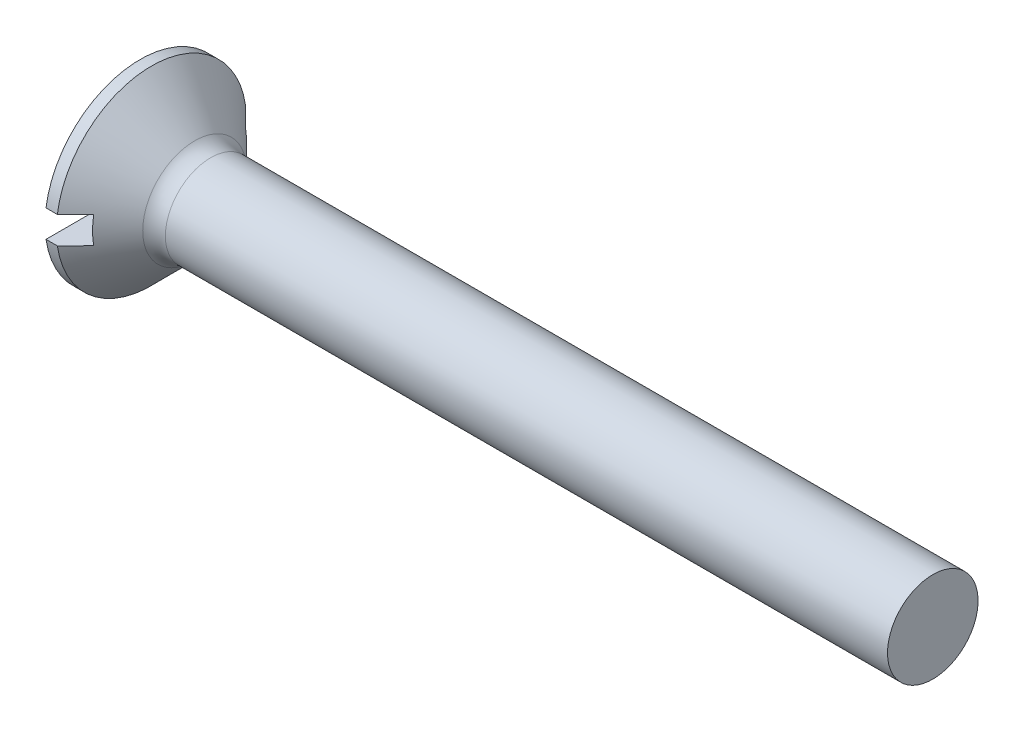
ISO-10303-21;
HEADER;
FILE_DESCRIPTION(('STEP AP214'),'2;1');
FILE_NAME('part.step','',(''),(''),'','','');
FILE_SCHEMA(('AUTOMOTIVE_DESIGN { 1 0 10303 214 1 1 1 1 }'));
ENDSEC;
DATA;
#1=APPLICATION_CONTEXT('core data for automotive mechanical design processes');
#2=APPLICATION_PROTOCOL_DEFINITION('international standard','automotive_design',2000,#1);
#3=PRODUCT_CONTEXT('',#1,'mechanical');
#4=PRODUCT('Part','Part','',(#3));
#5=PRODUCT_RELATED_PRODUCT_CATEGORY('part','',(#4));
#6=PRODUCT_DEFINITION_FORMATION('','',#4);
#7=PRODUCT_DEFINITION_CONTEXT('part definition',#1,'design');
#8=PRODUCT_DEFINITION('design','',#6,#7);
#9=PRODUCT_DEFINITION_SHAPE('','',#8);
#10=(LENGTH_UNIT() NAMED_UNIT(*) SI_UNIT(.MILLI.,.METRE.));
#11=(NAMED_UNIT(*) PLANE_ANGLE_UNIT() SI_UNIT($,.RADIAN.));
#12=(NAMED_UNIT(*) SI_UNIT($,.STERADIAN.) SOLID_ANGLE_UNIT());
#13=UNCERTAINTY_MEASURE_WITH_UNIT(LENGTH_MEASURE(1.E-05),#10,'distance_accuracy_value','');
#14=(GEOMETRIC_REPRESENTATION_CONTEXT(3) GLOBAL_UNCERTAINTY_ASSIGNED_CONTEXT((#13)) GLOBAL_UNIT_ASSIGNED_CONTEXT((#10,
#11,#12)) REPRESENTATION_CONTEXT('',''));
#15=CARTESIAN_POINT('',(0.,0.,0.));
#16=DIRECTION('',(0.,0.,1.));
#17=DIRECTION('',(1.,0.,0.));
#18=AXIS2_PLACEMENT_3D('',#15,#16,#17);
#19=CARTESIAN_POINT('',(0.,0.,0.));
#20=DIRECTION('',(-1.,0.,0.));
#21=DIRECTION('',(0.,0.,1.));
#22=AXIS2_PLACEMENT_3D('',#19,#20,#21);
#23=PLANE('',#22);
#24=DIRECTION('',(0.,0.,-1.));
#25=VECTOR('',#24,1.);
#26=CARTESIAN_POINT('',(0.,0.6,4.2));
#27=LINE('',#26,#25);
#28=CARTESIAN_POINT('',(0.,0.6,4.15692193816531));
#29=VERTEX_POINT('',#28);
#30=CARTESIAN_POINT('',(0.,0.599999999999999,-4.15692193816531));
#31=VERTEX_POINT('',#30);
#32=EDGE_CURVE('E170',#29,#31,#27,.T.);
#33=ORIENTED_EDGE('',*,*,#32,.F.);
#34=CARTESIAN_POINT('',(0.,0.,0.));
#35=DIRECTION('',(-1.,0.,0.));
#36=DIRECTION('',(0.,0.,1.));
#37=AXIS2_PLACEMENT_3D('',#34,#35,#36);
#38=CIRCLE('',#37,4.2);
#39=EDGE_CURVE('E114',#29,#31,#38,.T.);
#40=ORIENTED_EDGE('',*,*,#39,.T.);
#41=EDGE_LOOP('',(#33,#40));
#42=FACE_BOUND('',#41,.T.);
#43=ADVANCED_FACE('F33',(#42),#23,.T.);
#44=CARTESIAN_POINT('',(-6.34999999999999,0.,0.));
#45=DIRECTION('',(-1.,0.,0.));
#46=DIRECTION('',(0.,0.,1.));
#47=AXIS2_PLACEMENT_3D('',#44,#45,#46);
#48=CYLINDRICAL_SURFACE('',#47,4.2);
#49=DIRECTION('',(-1.,0.,0.));
#50=VECTOR('',#49,1.);
#51=CARTESIAN_POINT('',(-6.34999999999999,0.599999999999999,-4.15692193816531));
#52=LINE('',#51,#50);
#53=CARTESIAN_POINT('',(0.500000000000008,0.599999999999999,-4.15692193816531));
#54=VERTEX_POINT('',#53);
#55=EDGE_CURVE('E61',#31,#54,#52,.F.);
#56=ORIENTED_EDGE('',*,*,#55,.F.);
#57=ORIENTED_EDGE('',*,*,#39,.F.);
#58=DIRECTION('',(-1.,0.,0.));
#59=VECTOR('',#58,1.);
#60=CARTESIAN_POINT('',(-6.34999999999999,0.6,4.15692193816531));
#61=LINE('',#60,#59);
#62=CARTESIAN_POINT('',(0.500000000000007,0.6,4.15692193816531));
#63=VERTEX_POINT('',#62);
#64=EDGE_CURVE('E176',#63,#29,#61,.T.);
#65=ORIENTED_EDGE('',*,*,#64,.F.);
#66=CARTESIAN_POINT('',(0.500000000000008,0.,0.));
#67=DIRECTION('',(-1.,0.,0.));
#68=DIRECTION('',(0.,0.,1.));
#69=AXIS2_PLACEMENT_3D('',#66,#67,#68);
#70=CIRCLE('',#69,4.2);
#71=EDGE_CURVE('E108',#63,#54,#70,.T.);
#72=ORIENTED_EDGE('',*,*,#71,.T.);
#73=EDGE_LOOP('',(#56,#57,#65,#72));
#74=FACE_BOUND('',#73,.T.);
#75=ADVANCED_FACE('F154',(#74),#48,.T.);
#76=DIRECTION('',(0.,0.,1.));
#77=VECTOR('',#76,1.);
#78=CARTESIAN_POINT('',(0.,-0.600000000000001,-4.2));
#79=LINE('',#78,#77);
#80=CARTESIAN_POINT('',(0.,-0.600000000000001,-4.15692193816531));
#81=VERTEX_POINT('',#80);
#82=CARTESIAN_POINT('',(0.,-0.600000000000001,4.15692193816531));
#83=VERTEX_POINT('',#82);
#84=EDGE_CURVE('E102',#81,#83,#79,.T.);
#85=ORIENTED_EDGE('',*,*,#84,.F.);
#86=EDGE_CURVE('E110',#81,#83,#38,.T.);
#87=ORIENTED_EDGE('',*,*,#86,.T.);
#88=EDGE_LOOP('',(#85,#87));
#89=FACE_BOUND('',#88,.T.);
#90=ADVANCED_FACE('F156',(#89),#23,.T.);
#91=DIRECTION('',(-1.,0.,0.));
#92=VECTOR('',#91,1.);
#93=CARTESIAN_POINT('',(-6.34999999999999,-0.600000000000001,4.15692193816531));
#94=LINE('',#93,#92);
#95=CARTESIAN_POINT('',(0.500000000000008,-0.600000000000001,4.15692193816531));
#96=VERTEX_POINT('',#95);
#97=EDGE_CURVE('E175',#83,#96,#94,.F.);
#98=ORIENTED_EDGE('',*,*,#97,.F.);
#99=ORIENTED_EDGE('',*,*,#86,.F.);
#100=DIRECTION('',(-1.,0.,0.));
#101=VECTOR('',#100,1.);
#102=CARTESIAN_POINT('',(-6.34999999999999,-0.600000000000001,-4.15692193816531));
#103=LINE('',#102,#101);
#104=CARTESIAN_POINT('',(0.500000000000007,-0.600000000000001,-4.15692193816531));
#105=VERTEX_POINT('',#104);
#106=EDGE_CURVE('E173',#105,#81,#103,.T.);
#107=ORIENTED_EDGE('',*,*,#106,.F.);
#108=EDGE_CURVE('E111',#105,#96,#70,.T.);
#109=ORIENTED_EDGE('',*,*,#108,.T.);
#110=EDGE_LOOP('',(#98,#99,#107,#109));
#111=FACE_BOUND('',#110,.T.);
#112=ADVANCED_FACE('F151',(#111),#48,.T.);
#113=CARTESIAN_POINT('',(0.500000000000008,0.,0.));
#114=DIRECTION('',(-1.,0.,0.));
#115=DIRECTION('',(0.,0.,1.));
#116=AXIS2_PLACEMENT_3D('',#113,#114,#115);
#117=CONICAL_SURFACE('',#116,4.2,0.78539816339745);
#118=CARTESIAN_POINT('',(-4.56300554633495,0.599999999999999,-9.24355298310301));
#119=CARTESIAN_POINT('',(-4.24600723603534,0.599999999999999,-8.9258823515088));
#120=CARTESIAN_POINT('',(-3.92903833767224,0.599999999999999,-8.60818235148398));
#121=CARTESIAN_POINT('',(-3.29519089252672,0.599999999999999,-7.97268003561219));
#122=CARTESIAN_POINT('',(-2.97831234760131,0.599999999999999,-7.65487771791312));
#123=CARTESIAN_POINT('',(-2.34455187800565,0.599999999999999,-7.01900148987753));
#124=CARTESIAN_POINT('',(-2.02767001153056,0.599999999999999,-6.70092752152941));
#125=CARTESIAN_POINT('',(-1.39411705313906,0.599999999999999,-6.06458161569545));
#126=CARTESIAN_POINT('',(-1.07744595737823,0.599999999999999,-5.74630968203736));
#127=CARTESIAN_POINT('',(-0.439782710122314,0.599999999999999,-5.1047678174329));
#128=CARTESIAN_POINT('',(-0.118795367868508,0.599999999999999,-4.78149310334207));
#129=CARTESIAN_POINT('',(0.362237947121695,0.599999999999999,-4.2961185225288));
#130=CARTESIAN_POINT('',(0.522512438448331,0.599999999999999,-4.13424518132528));
#131=CARTESIAN_POINT('',(0.842841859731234,0.599999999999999,-3.81028322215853));
#132=CARTESIAN_POINT('',(1.00289679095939,0.6,-3.64819460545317));
#133=CARTESIAN_POINT('',(1.32264436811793,0.6,-3.32374686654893));
#134=CARTESIAN_POINT('',(1.48233710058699,0.6,-3.16138782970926));
#135=CARTESIAN_POINT('',(1.80122734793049,0.6,-2.83617699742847));
#136=CARTESIAN_POINT('',(1.96042485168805,0.6,-2.67332519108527));
#137=CARTESIAN_POINT('',(2.27798310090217,0.6,-2.346837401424));
#138=CARTESIAN_POINT('',(2.43634393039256,0.6,-2.1832015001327));
#139=CARTESIAN_POINT('',(2.67269924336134,0.6,-1.93661567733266));
#140=CARTESIAN_POINT('',(2.75128528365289,0.6,-1.8542332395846));
#141=CARTESIAN_POINT('',(2.90787263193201,0.6,-1.68891500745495));
#142=CARTESIAN_POINT('',(2.9858739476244,0.6,-1.60597922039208));
#143=CARTESIAN_POINT('',(3.10544684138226,0.6,-1.47745401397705));
#144=CARTESIAN_POINT('',(3.14733724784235,0.6,-1.43216144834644));
#145=CARTESIAN_POINT('',(3.23076972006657,0.6,-1.34125476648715));
#146=CARTESIAN_POINT('',(3.27231177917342,0.6,-1.29564064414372));
#147=CARTESIAN_POINT('',(3.35490511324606,0.6,-1.20402456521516));
#148=CARTESIAN_POINT('',(3.39595670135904,0.6,-1.15802289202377));
#149=CARTESIAN_POINT('',(3.47741398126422,0.6,-1.06545539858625));
#150=CARTESIAN_POINT('',(3.51781969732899,0.6,-1.01888959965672));
#151=CARTESIAN_POINT('',(3.61534617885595,0.6,-0.904304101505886));
#152=CARTESIAN_POINT('',(3.67198890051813,0.6,-0.835870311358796));
#153=CARTESIAN_POINT('',(3.75443491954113,0.6,-0.731128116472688));
#154=CARTESIAN_POINT('',(3.78151872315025,0.6,-0.695835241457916));
#155=CARTESIAN_POINT('',(3.83442818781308,0.6,-0.624333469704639));
#156=CARTESIAN_POINT('',(3.86025411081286,0.6,-0.58812476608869));
#157=CARTESIAN_POINT('',(3.91931375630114,0.6,-0.500871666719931));
#158=CARTESIAN_POINT('',(3.95177061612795,0.6,-0.449276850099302));
#159=CARTESIAN_POINT('',(3.99577967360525,0.6,-0.369336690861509));
#160=CARTESIAN_POINT('',(4.00966067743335,0.6,-0.342288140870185));
#161=CARTESIAN_POINT('',(4.03525638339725,0.6,-0.287195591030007));
#162=CARTESIAN_POINT('',(4.04697271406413,0.6,-0.259152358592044));
#163=CARTESIAN_POINT('',(4.06984222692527,0.6,-0.195380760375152));
#164=CARTESIAN_POINT('',(4.08024433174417,0.6,-0.159369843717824));
#165=CARTESIAN_POINT('',(4.09489065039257,0.6,-0.0861793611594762));
#166=CARTESIAN_POINT('',(4.09915715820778,0.6,-0.0490045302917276));
#167=CARTESIAN_POINT('',(4.10061628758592,0.6,0.0256851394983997));
#168=CARTESIAN_POINT('',(4.09777267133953,0.6,0.0632007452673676));
#169=CARTESIAN_POINT('',(4.08560858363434,0.6,0.137201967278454));
#170=CARTESIAN_POINT('',(4.07626994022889,0.6,0.173684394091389));
#171=CARTESIAN_POINT('',(4.05240105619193,0.6,0.246171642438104));
#172=CARTESIAN_POINT('',(4.03770931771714,0.6,0.282120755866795));
#173=CARTESIAN_POINT('',(4.0048507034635,0.6,0.352421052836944));
#174=CARTESIAN_POINT('',(3.98667753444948,0.6,0.386769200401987));
#175=CARTESIAN_POINT('',(3.94786976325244,0.6,0.454391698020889));
#176=CARTESIAN_POINT('',(3.92721638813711,0.6,0.487655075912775));
#177=CARTESIAN_POINT('',(3.88433578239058,0.6,0.553097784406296));
#178=CARTESIAN_POINT('',(3.86210991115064,0.6,0.585278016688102));
#179=CARTESIAN_POINT('',(3.81457382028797,0.6,0.651581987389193));
#180=CARTESIAN_POINT('',(3.7891630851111,0.6,0.685633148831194));
#181=CARTESIAN_POINT('',(3.73740972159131,0.6,0.753022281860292));
#182=CARTESIAN_POINT('',(3.71106696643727,0.6,0.786360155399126));
#183=CARTESIAN_POINT('',(3.63101189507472,0.6,0.885596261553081));
#184=CARTESIAN_POINT('',(3.57629754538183,0.6,0.950683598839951));
#185=CARTESIAN_POINT('',(3.46525380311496,0.6,1.07965626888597));
#186=CARTESIAN_POINT('',(3.40892163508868,0.6,1.14353918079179));
#187=CARTESIAN_POINT('',(3.29530585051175,0.6,1.27041803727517));
#188=CARTESIAN_POINT('',(3.23802251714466,0.6,1.33341423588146));
#189=CARTESIAN_POINT('',(3.12298479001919,0.6,1.45862383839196));
#190=CARTESIAN_POINT('',(3.06523233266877,0.6,1.52083902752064));
#191=CARTESIAN_POINT('',(2.94927074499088,0.6,1.64485037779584));
#192=CARTESIAN_POINT('',(2.89106158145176,0.6,1.70664650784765));
#193=CARTESIAN_POINT('',(2.71607782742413,0.6,1.8914362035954));
#194=CARTESIAN_POINT('',(2.598818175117,0.6,2.01396998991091));
#195=CARTESIAN_POINT('',(2.36411448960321,0.6,2.25774708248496));
#196=CARTESIAN_POINT('',(2.2466739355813,0.6,2.37899374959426));
#197=CARTESIAN_POINT('',(2.011320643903,0.6,2.62102822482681));
#198=CARTESIAN_POINT('',(1.89340790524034,0.6,2.74181603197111));
#199=CARTESIAN_POINT('',(1.53920067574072,0.6,3.10372997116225));
#200=CARTESIAN_POINT('',(1.30244210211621,0.6,3.34440153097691));
#201=CARTESIAN_POINT('',(0.828195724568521,0.6,3.82523070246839));
#202=CARTESIAN_POINT('',(0.590707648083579,0.6,4.06538804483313));
#203=CARTESIAN_POINT('',(0.115359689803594,0.6,4.54532999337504));
#204=CARTESIAN_POINT('',(-0.122500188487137,0.6,4.78511460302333));
#205=CARTESIAN_POINT('',(-0.598435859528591,0.6,5.26442998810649));
#206=CARTESIAN_POINT('',(-0.836511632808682,0.6,5.50396078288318));
#207=CARTESIAN_POINT('',(-1.31282357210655,0.6,5.9828640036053));
#208=CARTESIAN_POINT('',(-1.55105973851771,0.600000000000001,6.22223642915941));
#209=CARTESIAN_POINT('',(-2.26588146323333,0.600000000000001,6.94013600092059));
#210=CARTESIAN_POINT('',(-2.74263267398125,0.600000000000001,7.41849819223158));
#211=CARTESIAN_POINT('',(-3.33143893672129,0.600000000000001,8.0089998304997));
#212=CARTESIAN_POINT('',(-3.44338145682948,0.600000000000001,8.12125154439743));
#213=CARTESIAN_POINT('',(-3.66728071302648,0.600000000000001,8.34574469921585));
#214=CARTESIAN_POINT('',(-3.77923744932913,0.600000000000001,8.45798613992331));
#215=CARTESIAN_POINT('',(-4.0031582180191,0.600000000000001,8.68245495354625));
#216=CARTESIAN_POINT('',(-4.11512225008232,0.600000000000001,8.79468232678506));
#217=CARTESIAN_POINT('',(-4.33905795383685,0.600000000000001,9.019125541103));
#218=CARTESIAN_POINT('',(-4.45102962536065,0.600000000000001,9.13134138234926));
#219=CARTESIAN_POINT('',(-4.56300554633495,0.600000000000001,9.24355298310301));
#220=B_SPLINE_CURVE_WITH_KNOTS('',3,(#118,#119,#120,#121,#122,#123,#124,#125,#126,#127,#128,
#129,#130,#131,#132,#133,#134,#135,#136,#137,#138,#139,#140,#141,#142,#143,#144,#145,#146,#147,
#148,#149,#150,#151,#152,#153,#154,#155,#156,#157,#158,#159,#160,#161,#162,#163,#164,#165,#166,
#167,#168,#169,#170,#171,#172,#173,#174,#175,#176,#177,#178,#179,#180,#181,#182,#183,#184,#185,
#186,#187,#188,#189,#190,#191,#192,#193,#194,#195,#196,#197,#198,#199,#200,#201,#202,#203,#204,
#205,#206,#207,#208,#209,#210,#211,#212,#213,#214,#215,#216,#217,#218,#219),.UNSPECIFIED.,.F.,
.F.,(4,2,2,2,2,2,2,2,2,2,2,2,2,2,2,2,2,2,2,2,2,2,2,2,2,2,2,2,2,2,2,2,2,2,2,2,2,2,2,2,2,2,2,2,2,
2,2,2,2,2,4),(0.,1.34633691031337,2.6926997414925,4.03964677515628,5.38656852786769,
6.75326280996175,7.43664982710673,8.12003286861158,8.80323043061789,9.48644321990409,
10.1695860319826,10.5111450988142,10.8526996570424,11.03778202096,11.2228679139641,
11.4078285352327,11.5927821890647,11.8592146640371,11.9926530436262,12.1260635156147,
12.3086320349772,12.399769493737,12.490838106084,12.6028793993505,12.7145125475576,
12.8267158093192,12.939234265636,13.0554743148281,13.1719265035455,13.2893234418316,
13.4066201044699,13.5340600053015,13.6615173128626,13.91655652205,14.1720630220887,
14.4274947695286,14.6821578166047,14.9368395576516,15.4456347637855,15.9520298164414,
16.4584259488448,17.4712394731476,18.484493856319,19.4977387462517,20.5108998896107,
21.5240635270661,23.5501676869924,24.0257559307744,24.5013524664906,24.9769345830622,
25.4525083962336),.UNSPECIFIED.);
#221=CARTESIAN_POINT('',(1.3,0.6,3.34664010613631));
#222=VERTEX_POINT('',#221);
#223=EDGE_CURVE('E11',#222,#63,#220,.T.);
#224=ORIENTED_EDGE('',*,*,#223,.F.);
#225=CARTESIAN_POINT('',(1.3,0.,0.));
#226=DIRECTION('',(1.,0.,0.));
#227=DIRECTION('',(0.,0.,-1.));
#228=AXIS2_PLACEMENT_3D('',#225,#226,#227);
#229=CIRCLE('',#228,3.40000000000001);
#230=CARTESIAN_POINT('',(1.3,-0.600000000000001,3.34664010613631));
#231=VERTEX_POINT('',#230);
#232=EDGE_CURVE('E90',#231,#222,#229,.F.);
#233=ORIENTED_EDGE('',*,*,#232,.F.);
#234=CARTESIAN_POINT('',(-4.56300554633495,-0.600000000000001,9.24355298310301));
#235=CARTESIAN_POINT('',(-4.24600723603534,-0.600000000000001,8.9258823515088));
#236=CARTESIAN_POINT('',(-3.92903833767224,-0.600000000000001,8.60818235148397));
#237=CARTESIAN_POINT('',(-3.29519089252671,-0.600000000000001,7.97268003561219));
#238=CARTESIAN_POINT('',(-2.9783123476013,-0.600000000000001,7.65487771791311));
#239=CARTESIAN_POINT('',(-2.34455187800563,-0.600000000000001,7.01900148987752));
#240=CARTESIAN_POINT('',(-2.02767001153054,-0.600000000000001,6.7009275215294));
#241=CARTESIAN_POINT('',(-1.39411705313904,-0.600000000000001,6.06458161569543));
#242=CARTESIAN_POINT('',(-1.07744595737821,-0.600000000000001,5.74630968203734));
#243=CARTESIAN_POINT('',(-0.439782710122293,-0.600000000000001,5.10476781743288));
#244=CARTESIAN_POINT('',(-0.118795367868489,-0.600000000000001,4.78149310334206));
#245=CARTESIAN_POINT('',(0.362237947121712,-0.600000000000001,4.29611852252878));
#246=CARTESIAN_POINT('',(0.522512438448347,-0.600000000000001,4.13424518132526));
#247=CARTESIAN_POINT('',(0.842841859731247,-0.600000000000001,3.81028322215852));
#248=CARTESIAN_POINT('',(1.0028967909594,-0.600000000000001,3.64819460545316));
#249=CARTESIAN_POINT('',(1.32264436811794,-0.600000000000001,3.32374686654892));
#250=CARTESIAN_POINT('',(1.482337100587,-0.600000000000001,3.16138782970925));
#251=CARTESIAN_POINT('',(1.8012273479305,-0.600000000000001,2.83617699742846));
#252=CARTESIAN_POINT('',(1.96042485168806,-0.600000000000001,2.67332519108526));
#253=CARTESIAN_POINT('',(2.27798310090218,-0.600000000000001,2.346837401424));
#254=CARTESIAN_POINT('',(2.43634393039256,-0.600000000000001,2.18320150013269));
#255=CARTESIAN_POINT('',(2.67269924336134,-0.600000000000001,1.93661567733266));
#256=CARTESIAN_POINT('',(2.75128528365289,-0.600000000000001,1.85423323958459));
#257=CARTESIAN_POINT('',(2.90787263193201,-0.600000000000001,1.68891500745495));
#258=CARTESIAN_POINT('',(2.98587394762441,-0.600000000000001,1.60597922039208));
#259=CARTESIAN_POINT('',(3.10544684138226,-0.600000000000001,1.47745401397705));
#260=CARTESIAN_POINT('',(3.14733724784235,-0.600000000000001,1.43216144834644));
#261=CARTESIAN_POINT('',(3.23076972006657,-0.600000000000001,1.34125476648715));
#262=CARTESIAN_POINT('',(3.27231177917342,-0.600000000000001,1.29564064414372));
#263=CARTESIAN_POINT('',(3.35490511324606,-0.600000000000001,1.20402456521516));
#264=CARTESIAN_POINT('',(3.39595670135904,-0.600000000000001,1.15802289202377));
#265=CARTESIAN_POINT('',(3.47741398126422,-0.600000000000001,1.06545539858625));
#266=CARTESIAN_POINT('',(3.51781969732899,-0.600000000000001,1.01888959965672));
#267=CARTESIAN_POINT('',(3.61534617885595,-0.600000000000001,0.904304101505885));
#268=CARTESIAN_POINT('',(3.67198890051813,-0.600000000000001,0.835870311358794));
#269=CARTESIAN_POINT('',(3.75443491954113,-0.600000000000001,0.731128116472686));
#270=CARTESIAN_POINT('',(3.78151872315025,-0.600000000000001,0.695835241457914));
#271=CARTESIAN_POINT('',(3.83442818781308,-0.600000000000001,0.624333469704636));
#272=CARTESIAN_POINT('',(3.86025411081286,-0.600000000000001,0.588124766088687));
#273=CARTESIAN_POINT('',(3.91931375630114,-0.600000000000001,0.500871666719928));
#274=CARTESIAN_POINT('',(3.95177061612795,-0.600000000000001,0.449276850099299));
#275=CARTESIAN_POINT('',(3.99577967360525,-0.600000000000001,0.369336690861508));
#276=CARTESIAN_POINT('',(4.00966067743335,-0.600000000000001,0.342288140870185));
#277=CARTESIAN_POINT('',(4.03525638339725,-0.600000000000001,0.287195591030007));
#278=CARTESIAN_POINT('',(4.04697271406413,-0.600000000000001,0.259152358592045));
#279=CARTESIAN_POINT('',(4.06984222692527,-0.600000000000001,0.195380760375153));
#280=CARTESIAN_POINT('',(4.08024433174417,-0.600000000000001,0.159369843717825));
#281=CARTESIAN_POINT('',(4.09489065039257,-0.600000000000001,0.0861793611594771));
#282=CARTESIAN_POINT('',(4.09915715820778,-0.600000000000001,0.0490045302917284));
#283=CARTESIAN_POINT('',(4.10061628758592,-0.600000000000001,-0.0256851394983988));
#284=CARTESIAN_POINT('',(4.09777267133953,-0.600000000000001,-0.0632007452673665));
#285=CARTESIAN_POINT('',(4.08560858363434,-0.600000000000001,-0.137201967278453));
#286=CARTESIAN_POINT('',(4.07626994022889,-0.600000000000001,-0.173684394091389));
#287=CARTESIAN_POINT('',(4.05240105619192,-0.600000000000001,-0.246171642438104));
#288=CARTESIAN_POINT('',(4.03770931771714,-0.600000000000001,-0.282120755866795));
#289=CARTESIAN_POINT('',(4.0048507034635,-0.600000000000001,-0.352421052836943));
#290=CARTESIAN_POINT('',(3.98667753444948,-0.600000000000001,-0.386769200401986));
#291=CARTESIAN_POINT('',(3.94786976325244,-0.600000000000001,-0.454391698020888));
#292=CARTESIAN_POINT('',(3.92721638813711,-0.600000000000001,-0.487655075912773));
#293=CARTESIAN_POINT('',(3.88433578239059,-0.600000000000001,-0.553097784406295));
#294=CARTESIAN_POINT('',(3.86210991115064,-0.600000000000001,-0.585278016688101));
#295=CARTESIAN_POINT('',(3.81457382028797,-0.600000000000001,-0.651581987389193));
#296=CARTESIAN_POINT('',(3.7891630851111,-0.600000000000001,-0.685633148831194));
#297=CARTESIAN_POINT('',(3.73740972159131,-0.600000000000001,-0.753022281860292));
#298=CARTESIAN_POINT('',(3.71106696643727,-0.600000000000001,-0.786360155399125));
#299=CARTESIAN_POINT('',(3.63101189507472,-0.600000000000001,-0.88559626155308));
#300=CARTESIAN_POINT('',(3.57629754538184,-0.600000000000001,-0.950683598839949));
#301=CARTESIAN_POINT('',(3.46525380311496,-0.600000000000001,-1.07965626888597));
#302=CARTESIAN_POINT('',(3.40892163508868,-0.600000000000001,-1.14353918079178));
#303=CARTESIAN_POINT('',(3.29530585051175,-0.600000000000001,-1.27041803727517));
#304=CARTESIAN_POINT('',(3.23802251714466,-0.600000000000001,-1.33341423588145));
#305=CARTESIAN_POINT('',(3.12298479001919,-0.600000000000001,-1.45862383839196));
#306=CARTESIAN_POINT('',(3.06523233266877,-0.600000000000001,-1.52083902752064));
#307=CARTESIAN_POINT('',(2.94927074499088,-0.600000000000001,-1.64485037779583));
#308=CARTESIAN_POINT('',(2.89106158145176,-0.600000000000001,-1.70664650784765));
#309=CARTESIAN_POINT('',(2.71607782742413,-0.600000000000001,-1.8914362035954));
#310=CARTESIAN_POINT('',(2.598818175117,-0.600000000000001,-2.01396998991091));
#311=CARTESIAN_POINT('',(2.36411448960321,-0.600000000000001,-2.25774708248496));
#312=CARTESIAN_POINT('',(2.2466739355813,-0.600000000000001,-2.37899374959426));
#313=CARTESIAN_POINT('',(2.011320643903,-0.600000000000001,-2.62102822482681));
#314=CARTESIAN_POINT('',(1.89340790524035,-0.600000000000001,-2.74181603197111));
#315=CARTESIAN_POINT('',(1.53920067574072,-0.600000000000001,-3.10372997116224));
#316=CARTESIAN_POINT('',(1.30244210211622,-0.600000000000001,-3.34440153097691));
#317=CARTESIAN_POINT('',(0.828195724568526,-0.600000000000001,-3.82523070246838));
#318=CARTESIAN_POINT('',(0.590707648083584,-0.600000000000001,-4.06538804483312));
#319=CARTESIAN_POINT('',(0.1153596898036,-0.600000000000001,-4.54532999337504));
#320=CARTESIAN_POINT('',(-0.122500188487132,-0.600000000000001,-4.78511460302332));
#321=CARTESIAN_POINT('',(-0.598435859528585,-0.600000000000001,-5.26442998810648));
#322=CARTESIAN_POINT('',(-0.836511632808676,-0.600000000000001,-5.50396078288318));
#323=CARTESIAN_POINT('',(-1.31282357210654,-0.600000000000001,-5.98286400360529));
#324=CARTESIAN_POINT('',(-1.55105973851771,-0.600000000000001,-6.22223642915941));
#325=CARTESIAN_POINT('',(-2.26588146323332,-0.600000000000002,-6.94013600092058));
#326=CARTESIAN_POINT('',(-2.74263267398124,-0.600000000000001,-7.41849819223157));
#327=CARTESIAN_POINT('',(-3.33143893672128,-0.600000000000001,-8.00899983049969));
#328=CARTESIAN_POINT('',(-3.44338145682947,-0.600000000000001,-8.12125154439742));
#329=CARTESIAN_POINT('',(-3.66728071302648,-0.600000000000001,-8.34574469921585));
#330=CARTESIAN_POINT('',(-3.77923744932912,-0.600000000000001,-8.45798613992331));
#331=CARTESIAN_POINT('',(-4.0031582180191,-0.600000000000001,-8.68245495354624));
#332=CARTESIAN_POINT('',(-4.11512225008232,-0.600000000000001,-8.79468232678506));
#333=CARTESIAN_POINT('',(-4.33905795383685,-0.600000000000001,-9.019125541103));
#334=CARTESIAN_POINT('',(-4.45102962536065,-0.600000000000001,-9.13134138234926));
#335=CARTESIAN_POINT('',(-4.56300554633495,-0.600000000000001,-9.24355298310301));
#336=B_SPLINE_CURVE_WITH_KNOTS('',3,(#234,#235,#236,#237,#238,#239,#240,#241,#242,#243,#244,
#245,#246,#247,#248,#249,#250,#251,#252,#253,#254,#255,#256,#257,#258,#259,#260,#261,#262,#263,
#264,#265,#266,#267,#268,#269,#270,#271,#272,#273,#274,#275,#276,#277,#278,#279,#280,#281,#282,
#283,#284,#285,#286,#287,#288,#289,#290,#291,#292,#293,#294,#295,#296,#297,#298,#299,#300,#301,
#302,#303,#304,#305,#306,#307,#308,#309,#310,#311,#312,#313,#314,#315,#316,#317,#318,#319,#320,
#321,#322,#323,#324,#325,#326,#327,#328,#329,#330,#331,#332,#333,#334,#335),.UNSPECIFIED.,.F.,
.F.,(4,2,2,2,2,2,2,2,2,2,2,2,2,2,2,2,2,2,2,2,2,2,2,2,2,2,2,2,2,2,2,2,2,2,2,2,2,2,2,2,2,2,2,2,2,
2,2,2,2,2,4),(0.,1.34633691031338,2.69269974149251,4.0396467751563,5.38656852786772,
6.75326280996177,7.43664982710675,8.1200328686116,8.8032304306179,9.4864432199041,
10.1695860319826,10.5111450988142,10.8526996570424,11.03778202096,11.2228679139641,
11.4078285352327,11.5927821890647,11.8592146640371,11.9926530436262,12.1260635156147,
12.3086320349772,12.399769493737,12.490838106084,12.6028793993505,12.7145125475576,
12.8267158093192,12.939234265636,13.0554743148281,13.1719265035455,13.2893234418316,
13.4066201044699,13.5340600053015,13.6615173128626,13.91655652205,14.1720630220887,
14.4274947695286,14.6821578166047,14.9368395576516,15.4456347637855,15.9520298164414,
16.4584259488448,17.4712394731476,18.484493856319,19.4977387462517,20.5108998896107,
21.5240635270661,23.5501676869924,24.0257559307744,24.5013524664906,24.9769345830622,
25.4525083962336),.UNSPECIFIED.);
#337=EDGE_CURVE('E47',#96,#231,#336,.T.);
#338=ORIENTED_EDGE('',*,*,#337,.F.);
#339=ORIENTED_EDGE('',*,*,#108,.F.);
#340=CARTESIAN_POINT('',(1.3,-0.600000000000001,-3.34664010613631));
#341=VERTEX_POINT('',#340);
#342=EDGE_CURVE('E126',#341,#105,#336,.T.);
#343=ORIENTED_EDGE('',*,*,#342,.F.);
#344=CARTESIAN_POINT('',(1.3,0.6,-3.34664010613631));
#345=VERTEX_POINT('',#344);
#346=EDGE_CURVE('E98',#345,#341,#229,.F.);
#347=ORIENTED_EDGE('',*,*,#346,.F.);
#348=EDGE_CURVE('E37',#54,#345,#220,.T.);
#349=ORIENTED_EDGE('',*,*,#348,.F.);
#350=ORIENTED_EDGE('',*,*,#71,.F.);
#351=EDGE_LOOP('',(#224,#233,#338,#339,#343,#347,#349,#350));
#352=FACE_BOUND('',#351,.T.);
#353=CARTESIAN_POINT('',(2.40710678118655,0.,0.));
#354=DIRECTION('',(-1.,0.,0.));
#355=DIRECTION('',(0.,0.,1.));
#356=AXIS2_PLACEMENT_3D('',#353,#354,#355);
#357=CIRCLE('',#356,2.29289321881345);
#358=CARTESIAN_POINT('',(2.40710678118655,0.,2.29289321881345));
#359=VERTEX_POINT('',#358);
#360=EDGE_CURVE('E121',#359,#359,#357,.T.);
#361=ORIENTED_EDGE('',*,*,#360,.T.);
#362=EDGE_LOOP('',(#361));
#363=FACE_BOUND('',#362,.T.);
#364=ADVANCED_FACE('F105',(#352,#363),#117,.T.);
#365=CARTESIAN_POINT('',(-6.34999999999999,0.,0.));
#366=DIRECTION('',(-1.,0.,0.));
#367=DIRECTION('',(0.,0.,1.));
#368=AXIS2_PLACEMENT_3D('',#365,#366,#367);
#369=CYLINDRICAL_SURFACE('',#368,2.);
#370=CARTESIAN_POINT('',(3.1142135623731,0.,0.));
#371=DIRECTION('',(-1.,0.,0.));
#372=DIRECTION('',(0.,0.,1.));
#373=AXIS2_PLACEMENT_3D('',#370,#371,#372);
#374=CIRCLE('',#373,2.);
#375=CARTESIAN_POINT('',(3.1142135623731,0.,2.));
#376=VERTEX_POINT('',#375);
#377=EDGE_CURVE('E124',#376,#376,#374,.F.);
#378=ORIENTED_EDGE('',*,*,#377,.T.);
#379=EDGE_LOOP('',(#378));
#380=FACE_BOUND('',#379,.T.);
#381=CARTESIAN_POINT('',(35.,0.,0.));
#382=DIRECTION('',(-1.,0.,0.));
#383=DIRECTION('',(0.,0.,1.));
#384=AXIS2_PLACEMENT_3D('',#381,#382,#383);
#385=CIRCLE('',#384,2.);
#386=CARTESIAN_POINT('',(35.,0.,2.));
#387=VERTEX_POINT('',#386);
#388=EDGE_CURVE('E117',#387,#387,#385,.T.);
#389=ORIENTED_EDGE('',*,*,#388,.T.);
#390=EDGE_LOOP('',(#389));
#391=FACE_BOUND('',#390,.T.);
#392=ADVANCED_FACE('F144',(#380,#391),#369,.T.);
#393=CARTESIAN_POINT('',(35.,2.,0.));
#394=DIRECTION('',(1.,0.,0.));
#395=DIRECTION('',(0.,0.,-1.));
#396=AXIS2_PLACEMENT_3D('',#393,#394,#395);
#397=PLANE('',#396);
#398=ORIENTED_EDGE('',*,*,#388,.F.);
#399=EDGE_LOOP('',(#398));
#400=FACE_BOUND('',#399,.T.);
#401=ADVANCED_FACE('F142',(#400),#397,.T.);
#402=CARTESIAN_POINT('',(3.1142135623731,0.,0.));
#403=DIRECTION('',(-1.,0.,0.));
#404=DIRECTION('',(0.,0.,1.));
#405=AXIS2_PLACEMENT_3D('',#402,#403,#404);
#406=TOROIDAL_SURFACE('',#405,3.,1.);
#407=ORIENTED_EDGE('',*,*,#377,.F.);
#408=EDGE_LOOP('',(#407));
#409=FACE_BOUND('',#408,.T.);
#410=ORIENTED_EDGE('',*,*,#360,.F.);
#411=EDGE_LOOP('',(#410));
#412=FACE_BOUND('',#411,.T.);
#413=ADVANCED_FACE('F35',(#409,#412),#406,.F.);
#414=CARTESIAN_POINT('',(1.3,0.6,4.2));
#415=DIRECTION('',(0.,1.,0.));
#416=DIRECTION('',(0.,0.,1.));
#417=AXIS2_PLACEMENT_3D('',#414,#415,#416);
#418=PLANE('',#417);
#419=ORIENTED_EDGE('',*,*,#55,.T.);
#420=ORIENTED_EDGE('',*,*,#348,.T.);
#421=DIRECTION('',(0.,0.,-1.));
#422=VECTOR('',#421,1.);
#423=CARTESIAN_POINT('',(1.3,0.6,4.2));
#424=LINE('',#423,#422);
#425=EDGE_CURVE('E54',#222,#345,#424,.T.);
#426=ORIENTED_EDGE('',*,*,#425,.F.);
#427=ORIENTED_EDGE('',*,*,#223,.T.);
#428=ORIENTED_EDGE('',*,*,#64,.T.);
#429=ORIENTED_EDGE('',*,*,#32,.T.);
#430=EDGE_LOOP('',(#419,#420,#426,#427,#428,#429));
#431=FACE_BOUND('',#430,.T.);
#432=ADVANCED_FACE('F99',(#431),#418,.F.);
#433=CARTESIAN_POINT('',(1.3,-0.600000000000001,-4.2));
#434=DIRECTION('',(0.,-1.,0.));
#435=DIRECTION('',(0.,0.,-1.));
#436=AXIS2_PLACEMENT_3D('',#433,#434,#435);
#437=PLANE('',#436);
#438=ORIENTED_EDGE('',*,*,#97,.T.);
#439=ORIENTED_EDGE('',*,*,#337,.T.);
#440=DIRECTION('',(0.,0.,1.));
#441=VECTOR('',#440,1.);
#442=CARTESIAN_POINT('',(1.3,-0.600000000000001,-4.2));
#443=LINE('',#442,#441);
#444=EDGE_CURVE('E93',#341,#231,#443,.T.);
#445=ORIENTED_EDGE('',*,*,#444,.F.);
#446=ORIENTED_EDGE('',*,*,#342,.T.);
#447=ORIENTED_EDGE('',*,*,#106,.T.);
#448=ORIENTED_EDGE('',*,*,#84,.T.);
#449=EDGE_LOOP('',(#438,#439,#445,#446,#447,#448));
#450=FACE_BOUND('',#449,.T.);
#451=ADVANCED_FACE('F134',(#450),#437,.F.);
#452=CARTESIAN_POINT('',(1.3,-0.600000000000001,-4.2));
#453=DIRECTION('',(1.,0.,0.));
#454=DIRECTION('',(0.,0.,-1.));
#455=AXIS2_PLACEMENT_3D('',#452,#453,#454);
#456=PLANE('',#455);
#457=ORIENTED_EDGE('',*,*,#232,.T.);
#458=ORIENTED_EDGE('',*,*,#425,.T.);
#459=ORIENTED_EDGE('',*,*,#346,.T.);
#460=ORIENTED_EDGE('',*,*,#444,.T.);
#461=EDGE_LOOP('',(#457,#458,#459,#460));
#462=FACE_BOUND('',#461,.T.);
#463=ADVANCED_FACE('F91',(#462),#456,.F.);
#464=CLOSED_SHELL('',(#43,#75,#90,#112,#364,#392,#401,#413,#432,#451,#463));
#465=MANIFOLD_SOLID_BREP('B2',#464);
#466=ADVANCED_BREP_SHAPE_REPRESENTATION('',(#18,#465),#14);
#467=SHAPE_DEFINITION_REPRESENTATION(#9,#466);
ENDSEC;
END-ISO-10303-21;
